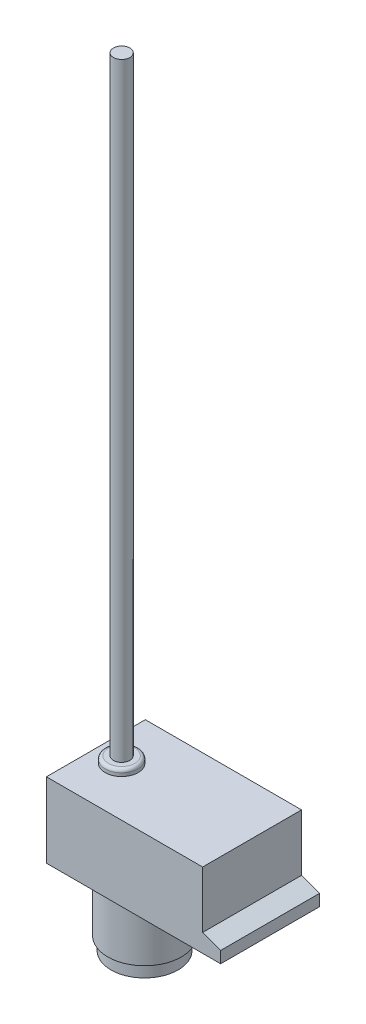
ISO-10303-21;
HEADER;
FILE_DESCRIPTION(('STEP AP214'),'2;1');
FILE_NAME('part.step','',(''),(''),'','','');
FILE_SCHEMA(('AUTOMOTIVE_DESIGN { 1 0 10303 214 1 1 1 1 }'));
ENDSEC;
DATA;
#1=APPLICATION_CONTEXT('core data for automotive mechanical design processes');
#2=APPLICATION_PROTOCOL_DEFINITION('international standard','automotive_design',2000,#1);
#3=PRODUCT_CONTEXT('',#1,'mechanical');
#4=PRODUCT('Part','Part','',(#3));
#5=PRODUCT_RELATED_PRODUCT_CATEGORY('part','',(#4));
#6=PRODUCT_DEFINITION_FORMATION('','',#4);
#7=PRODUCT_DEFINITION_CONTEXT('part definition',#1,'design');
#8=PRODUCT_DEFINITION('design','',#6,#7);
#9=PRODUCT_DEFINITION_SHAPE('','',#8);
#10=(LENGTH_UNIT() NAMED_UNIT(*) SI_UNIT(.MILLI.,.METRE.));
#11=(NAMED_UNIT(*) PLANE_ANGLE_UNIT() SI_UNIT($,.RADIAN.));
#12=(NAMED_UNIT(*) SI_UNIT($,.STERADIAN.) SOLID_ANGLE_UNIT());
#13=UNCERTAINTY_MEASURE_WITH_UNIT(LENGTH_MEASURE(1.E-05),#10,'distance_accuracy_value','');
#14=(GEOMETRIC_REPRESENTATION_CONTEXT(3) GLOBAL_UNCERTAINTY_ASSIGNED_CONTEXT((#13)) GLOBAL_UNIT_ASSIGNED_CONTEXT((#10,
#11,#12)) REPRESENTATION_CONTEXT('',''));
#15=CARTESIAN_POINT('',(0.,0.,0.));
#16=DIRECTION('',(0.,0.,1.));
#17=DIRECTION('',(1.,0.,0.));
#18=AXIS2_PLACEMENT_3D('',#15,#16,#17);
#19=CARTESIAN_POINT('',(-34.35,0.,19.5));
#20=DIRECTION('',(1.,0.,0.));
#21=DIRECTION('',(0.,0.,-1.));
#22=AXIS2_PLACEMENT_3D('',#19,#20,#21);
#23=PLANE('',#22);
#24=DIRECTION('',(0.,-1.,0.));
#25=VECTOR('',#24,1.);
#26=CARTESIAN_POINT('',(-34.35,0.,-19.5));
#27=LINE('',#26,#25);
#28=CARTESIAN_POINT('',(-34.35,29.4999999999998,-19.5));
#29=VERTEX_POINT('',#28);
#30=CARTESIAN_POINT('',(-34.35,0.,-19.5));
#31=VERTEX_POINT('',#30);
#32=EDGE_CURVE('E124',#29,#31,#27,.T.);
#33=ORIENTED_EDGE('',*,*,#32,.T.);
#34=DIRECTION('',(0.,0.,-1.));
#35=VECTOR('',#34,1.);
#36=CARTESIAN_POINT('',(-34.35,0.,19.5));
#37=LINE('',#36,#35);
#38=CARTESIAN_POINT('',(-34.35,0.,19.5));
#39=VERTEX_POINT('',#38);
#40=EDGE_CURVE('E142',#39,#31,#37,.T.);
#41=ORIENTED_EDGE('',*,*,#40,.F.);
#42=DIRECTION('',(0.,-1.,0.));
#43=VECTOR('',#42,1.);
#44=CARTESIAN_POINT('',(-34.35,0.,19.5));
#45=LINE('',#44,#43);
#46=CARTESIAN_POINT('',(-34.35,29.4999999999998,19.5));
#47=VERTEX_POINT('',#46);
#48=EDGE_CURVE('E135',#47,#39,#45,.T.);
#49=ORIENTED_EDGE('',*,*,#48,.F.);
#50=DIRECTION('',(0.,0.,-1.));
#51=VECTOR('',#50,1.);
#52=CARTESIAN_POINT('',(-34.35,29.4999999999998,19.5));
#53=LINE('',#52,#51);
#54=EDGE_CURVE('E120',#47,#29,#53,.T.);
#55=ORIENTED_EDGE('',*,*,#54,.T.);
#56=EDGE_LOOP('',(#33,#41,#49,#55));
#57=FACE_BOUND('',#56,.T.);
#58=ADVANCED_FACE('F35',(#57),#23,.F.);
#59=CARTESIAN_POINT('',(-34.35,0.,19.5));
#60=DIRECTION('',(0.,1.,0.));
#61=DIRECTION('',(-1.,0.,0.));
#62=AXIS2_PLACEMENT_3D('',#59,#60,#61);
#63=PLANE('',#62);
#64=CARTESIAN_POINT('',(4.84999999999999,0.,10.));
#65=DIRECTION('',(0.,-1.,0.));
#66=DIRECTION('',(0.,0.,-1.));
#67=AXIS2_PLACEMENT_3D('',#64,#65,#66);
#68=CIRCLE('',#67,1.64999999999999);
#69=CARTESIAN_POINT('',(4.84999999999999,0.,8.35000000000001));
#70=VERTEX_POINT('',#69);
#71=EDGE_CURVE('E237',#70,#70,#68,.T.);
#72=ORIENTED_EDGE('',*,*,#71,.F.);
#73=EDGE_LOOP('',(#72));
#74=FACE_BOUND('',#73,.T.);
#75=CARTESIAN_POINT('',(4.84999999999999,0.,-10.));
#76=DIRECTION('',(0.,-1.,0.));
#77=DIRECTION('',(0.,0.,-1.));
#78=AXIS2_PLACEMENT_3D('',#75,#76,#77);
#79=CIRCLE('',#78,1.64999999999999);
#80=CARTESIAN_POINT('',(4.84999999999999,0.,-11.65));
#81=VERTEX_POINT('',#80);
#82=EDGE_CURVE('E239',#81,#81,#79,.T.);
#83=ORIENTED_EDGE('',*,*,#82,.F.);
#84=EDGE_LOOP('',(#83));
#85=FACE_BOUND('',#84,.T.);
#86=CARTESIAN_POINT('',(-15.15,0.,0.));
#87=DIRECTION('',(0.,1.,0.));
#88=DIRECTION('',(0.,0.,1.));
#89=AXIS2_PLACEMENT_3D('',#86,#87,#88);
#90=CIRCLE('',#89,14.5);
#91=CARTESIAN_POINT('',(-15.15,0.,14.5));
#92=VERTEX_POINT('',#91);
#93=EDGE_CURVE('E128',#92,#92,#90,.T.);
#94=ORIENTED_EDGE('',*,*,#93,.T.);
#95=EDGE_LOOP('',(#94));
#96=FACE_BOUND('',#95,.T.);
#97=DIRECTION('',(1.,0.,0.));
#98=VECTOR('',#97,1.);
#99=CARTESIAN_POINT('',(-34.35,0.,-19.5));
#100=LINE('',#99,#98);
#101=CARTESIAN_POINT('',(34.35,0.,-19.5));
#102=VERTEX_POINT('',#101);
#103=EDGE_CURVE('E127',#31,#102,#100,.T.);
#104=ORIENTED_EDGE('',*,*,#103,.T.);
#105=DIRECTION('',(0.,0.,-1.));
#106=VECTOR('',#105,1.);
#107=CARTESIAN_POINT('',(34.35,0.,19.5));
#108=LINE('',#107,#106);
#109=CARTESIAN_POINT('',(34.35,0.,19.5));
#110=VERTEX_POINT('',#109);
#111=EDGE_CURVE('E139',#110,#102,#108,.T.);
#112=ORIENTED_EDGE('',*,*,#111,.F.);
#113=DIRECTION('',(1.,0.,0.));
#114=VECTOR('',#113,1.);
#115=CARTESIAN_POINT('',(-34.35,0.,19.5));
#116=LINE('',#115,#114);
#117=EDGE_CURVE('E91',#39,#110,#116,.T.);
#118=ORIENTED_EDGE('',*,*,#117,.F.);
#119=ORIENTED_EDGE('',*,*,#40,.T.);
#120=EDGE_LOOP('',(#104,#112,#118,#119));
#121=FACE_BOUND('',#120,.T.);
#122=ADVANCED_FACE('F166',(#74,#85,#96,#121),#63,.F.);
#123=CARTESIAN_POINT('',(34.35,0.,19.5));
#124=DIRECTION('',(-1.,0.,0.));
#125=DIRECTION('',(0.,0.,1.));
#126=AXIS2_PLACEMENT_3D('',#123,#124,#125);
#127=PLANE('',#126);
#128=DIRECTION('',(0.,1.,0.));
#129=VECTOR('',#128,1.);
#130=CARTESIAN_POINT('',(34.35,0.,-19.5));
#131=LINE('',#130,#129);
#132=CARTESIAN_POINT('',(34.35,4.572,-19.5));
#133=VERTEX_POINT('',#132);
#134=EDGE_CURVE('E130',#102,#133,#131,.T.);
#135=ORIENTED_EDGE('',*,*,#134,.T.);
#136=DIRECTION('',(0.,0.,-1.));
#137=VECTOR('',#136,1.);
#138=CARTESIAN_POINT('',(34.35,4.572,19.5));
#139=LINE('',#138,#137);
#140=CARTESIAN_POINT('',(34.35,4.572,19.5));
#141=VERTEX_POINT('',#140);
#142=EDGE_CURVE('E115',#141,#133,#139,.T.);
#143=ORIENTED_EDGE('',*,*,#142,.F.);
#144=DIRECTION('',(0.,1.,0.));
#145=VECTOR('',#144,1.);
#146=CARTESIAN_POINT('',(34.35,0.,19.5));
#147=LINE('',#146,#145);
#148=EDGE_CURVE('E106',#110,#141,#147,.T.);
#149=ORIENTED_EDGE('',*,*,#148,.F.);
#150=ORIENTED_EDGE('',*,*,#111,.T.);
#151=EDGE_LOOP('',(#135,#143,#149,#150));
#152=FACE_BOUND('',#151,.T.);
#153=ADVANCED_FACE('F171',(#152),#127,.F.);
#154=CARTESIAN_POINT('',(34.35,4.572,19.5));
#155=DIRECTION('',(-0.340553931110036,-0.94022498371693,0.));
#156=DIRECTION('',(0.94022498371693,-0.340553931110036,0.));
#157=AXIS2_PLACEMENT_3D('',#154,#155,#156);
#158=PLANE('',#157);
#159=DIRECTION('',(-0.94022498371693,0.340553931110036,0.));
#160=VECTOR('',#159,1.);
#161=CARTESIAN_POINT('',(34.35,4.572,-19.5));
#162=LINE('',#161,#160);
#163=CARTESIAN_POINT('',(27.238,7.14799999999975,-19.5));
#164=VERTEX_POINT('',#163);
#165=EDGE_CURVE('E114',#133,#164,#162,.T.);
#166=ORIENTED_EDGE('',*,*,#165,.T.);
#167=DIRECTION('',(0.,0.,-1.));
#168=VECTOR('',#167,1.);
#169=CARTESIAN_POINT('',(27.238,7.14799999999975,19.5));
#170=LINE('',#169,#168);
#171=CARTESIAN_POINT('',(27.238,7.14799999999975,19.5));
#172=VERTEX_POINT('',#171);
#173=EDGE_CURVE('E111',#172,#164,#170,.T.);
#174=ORIENTED_EDGE('',*,*,#173,.F.);
#175=DIRECTION('',(-0.94022498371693,0.340553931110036,0.));
#176=VECTOR('',#175,1.);
#177=CARTESIAN_POINT('',(34.35,4.572,19.5));
#178=LINE('',#177,#176);
#179=EDGE_CURVE('E100',#141,#172,#178,.T.);
#180=ORIENTED_EDGE('',*,*,#179,.F.);
#181=ORIENTED_EDGE('',*,*,#142,.T.);
#182=EDGE_LOOP('',(#166,#174,#180,#181));
#183=FACE_BOUND('',#182,.T.);
#184=ADVANCED_FACE('F112',(#183),#158,.F.);
#185=CARTESIAN_POINT('',(27.238,7.14799999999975,19.5));
#186=DIRECTION('',(-1.,0.,0.));
#187=DIRECTION('',(0.,0.,1.));
#188=AXIS2_PLACEMENT_3D('',#185,#186,#187);
#189=PLANE('',#188);
#190=DIRECTION('',(0.,1.,0.));
#191=VECTOR('',#190,1.);
#192=CARTESIAN_POINT('',(27.238,7.14799999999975,-19.5));
#193=LINE('',#192,#191);
#194=CARTESIAN_POINT('',(27.238,29.4999999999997,-19.5));
#195=VERTEX_POINT('',#194);
#196=EDGE_CURVE('E76',#164,#195,#193,.T.);
#197=ORIENTED_EDGE('',*,*,#196,.T.);
#198=DIRECTION('',(0.,0.,-1.));
#199=VECTOR('',#198,1.);
#200=CARTESIAN_POINT('',(27.238,29.4999999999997,19.5));
#201=LINE('',#200,#199);
#202=CARTESIAN_POINT('',(27.238,29.4999999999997,19.5));
#203=VERTEX_POINT('',#202);
#204=EDGE_CURVE('E116',#203,#195,#201,.T.);
#205=ORIENTED_EDGE('',*,*,#204,.F.);
#206=DIRECTION('',(0.,1.,0.));
#207=VECTOR('',#206,1.);
#208=CARTESIAN_POINT('',(27.238,7.14799999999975,19.5));
#209=LINE('',#208,#207);
#210=EDGE_CURVE('E104',#172,#203,#209,.T.);
#211=ORIENTED_EDGE('',*,*,#210,.F.);
#212=ORIENTED_EDGE('',*,*,#173,.T.);
#213=EDGE_LOOP('',(#197,#205,#211,#212));
#214=FACE_BOUND('',#213,.T.);
#215=ADVANCED_FACE('F118',(#214),#189,.F.);
#216=CARTESIAN_POINT('',(27.238,29.4999999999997,19.5));
#217=DIRECTION('',(0.,-1.,0.));
#218=DIRECTION('',(1.,0.,0.));
#219=AXIS2_PLACEMENT_3D('',#216,#217,#218);
#220=PLANE('',#219);
#221=CARTESIAN_POINT('',(-24.19,29.4999999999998,0.));
#222=DIRECTION('',(0.,-1.,0.));
#223=DIRECTION('',(1.,0.,0.));
#224=AXIS2_PLACEMENT_3D('',#221,#222,#223);
#225=CIRCLE('',#224,6.50000000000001);
#226=CARTESIAN_POINT('',(-17.69,29.4999999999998,0.));
#227=VERTEX_POINT('',#226);
#228=EDGE_CURVE('E144',#227,#227,#225,.F.);
#229=ORIENTED_EDGE('',*,*,#228,.F.);
#230=EDGE_LOOP('',(#229));
#231=FACE_BOUND('',#230,.T.);
#232=DIRECTION('',(-1.,0.,0.));
#233=VECTOR('',#232,1.);
#234=CARTESIAN_POINT('',(27.238,29.4999999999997,-19.5));
#235=LINE('',#234,#233);
#236=EDGE_CURVE('E82',#195,#29,#235,.T.);
#237=ORIENTED_EDGE('',*,*,#236,.T.);
#238=ORIENTED_EDGE('',*,*,#54,.F.);
#239=DIRECTION('',(-1.,0.,0.));
#240=VECTOR('',#239,1.);
#241=CARTESIAN_POINT('',(27.238,29.4999999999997,19.5));
#242=LINE('',#241,#240);
#243=EDGE_CURVE('E52',#203,#47,#242,.T.);
#244=ORIENTED_EDGE('',*,*,#243,.F.);
#245=ORIENTED_EDGE('',*,*,#204,.T.);
#246=EDGE_LOOP('',(#237,#238,#244,#245));
#247=FACE_BOUND('',#246,.T.);
#248=ADVANCED_FACE('F182',(#231,#247),#220,.F.);
#249=CARTESIAN_POINT('',(0.,0.,19.5));
#250=DIRECTION('',(0.,0.,1.));
#251=DIRECTION('',(1.,0.,0.));
#252=AXIS2_PLACEMENT_3D('',#249,#250,#251);
#253=PLANE('',#252);
#254=ORIENTED_EDGE('',*,*,#48,.T.);
#255=ORIENTED_EDGE('',*,*,#117,.T.);
#256=ORIENTED_EDGE('',*,*,#148,.T.);
#257=ORIENTED_EDGE('',*,*,#179,.T.);
#258=ORIENTED_EDGE('',*,*,#210,.T.);
#259=ORIENTED_EDGE('',*,*,#243,.T.);
#260=EDGE_LOOP('',(#254,#255,#256,#257,#258,#259));
#261=FACE_BOUND('',#260,.T.);
#262=ADVANCED_FACE('F102',(#261),#253,.T.);
#263=CARTESIAN_POINT('',(0.,0.,-19.5));
#264=DIRECTION('',(0.,0.,1.));
#265=DIRECTION('',(1.,0.,0.));
#266=AXIS2_PLACEMENT_3D('',#263,#264,#265);
#267=PLANE('',#266);
#268=ORIENTED_EDGE('',*,*,#32,.F.);
#269=ORIENTED_EDGE('',*,*,#236,.F.);
#270=ORIENTED_EDGE('',*,*,#196,.F.);
#271=ORIENTED_EDGE('',*,*,#165,.F.);
#272=ORIENTED_EDGE('',*,*,#134,.F.);
#273=ORIENTED_EDGE('',*,*,#103,.F.);
#274=EDGE_LOOP('',(#268,#269,#270,#271,#272,#273));
#275=FACE_BOUND('',#274,.T.);
#276=ADVANCED_FACE('F186',(#275),#267,.F.);
#277=CARTESIAN_POINT('',(-15.15,29.4999999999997,0.));
#278=DIRECTION('',(0.,1.,0.));
#279=DIRECTION('',(0.,0.,1.));
#280=AXIS2_PLACEMENT_3D('',#277,#278,#279);
#281=CYLINDRICAL_SURFACE('',#280,14.5);
#282=CARTESIAN_POINT('',(-15.15,-24.9200000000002,0.));
#283=DIRECTION('',(0.,1.,0.));
#284=DIRECTION('',(0.,0.,1.));
#285=AXIS2_PLACEMENT_3D('',#282,#283,#284);
#286=CIRCLE('',#285,14.5);
#287=CARTESIAN_POINT('',(-15.15,-24.9200000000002,14.5));
#288=VERTEX_POINT('',#287);
#289=EDGE_CURVE('E259',#288,#288,#286,.T.);
#290=ORIENTED_EDGE('',*,*,#289,.T.);
#291=EDGE_LOOP('',(#290));
#292=FACE_BOUND('',#291,.T.);
#293=ORIENTED_EDGE('',*,*,#93,.F.);
#294=EDGE_LOOP('',(#293));
#295=FACE_BOUND('',#294,.T.);
#296=ADVANCED_FACE('F189',(#292,#295),#281,.T.);
#297=CARTESIAN_POINT('',(-15.15,-24.9200000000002,14.5));
#298=DIRECTION('',(0.,-1.,0.));
#299=DIRECTION('',(0.,0.,-1.));
#300=AXIS2_PLACEMENT_3D('',#297,#298,#299);
#301=PLANE('',#300);
#302=CARTESIAN_POINT('',(-15.15,-24.9200000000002,0.));
#303=DIRECTION('',(0.,1.,0.));
#304=DIRECTION('',(0.,0.,1.));
#305=AXIS2_PLACEMENT_3D('',#302,#303,#304);
#306=CIRCLE('',#305,13.23);
#307=CARTESIAN_POINT('',(-15.15,-24.9200000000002,13.23));
#308=VERTEX_POINT('',#307);
#309=EDGE_CURVE('E256',#308,#308,#306,.T.);
#310=ORIENTED_EDGE('',*,*,#309,.T.);
#311=EDGE_LOOP('',(#310));
#312=FACE_BOUND('',#311,.T.);
#313=ORIENTED_EDGE('',*,*,#289,.F.);
#314=EDGE_LOOP('',(#313));
#315=FACE_BOUND('',#314,.T.);
#316=ADVANCED_FACE('F195',(#312,#315),#301,.T.);
#317=CARTESIAN_POINT('',(-15.15,29.4999999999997,0.));
#318=DIRECTION('',(0.,1.,0.));
#319=DIRECTION('',(0.,0.,1.));
#320=AXIS2_PLACEMENT_3D('',#317,#318,#319);
#321=CYLINDRICAL_SURFACE('',#320,13.23);
#322=CARTESIAN_POINT('',(-15.15,-30.0000000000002,0.));
#323=DIRECTION('',(0.,1.,0.));
#324=DIRECTION('',(0.,0.,1.));
#325=AXIS2_PLACEMENT_3D('',#322,#323,#324);
#326=CIRCLE('',#325,13.23);
#327=CARTESIAN_POINT('',(-15.15,-30.0000000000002,13.23));
#328=VERTEX_POINT('',#327);
#329=EDGE_CURVE('E251',#328,#328,#326,.T.);
#330=ORIENTED_EDGE('',*,*,#329,.T.);
#331=EDGE_LOOP('',(#330));
#332=FACE_BOUND('',#331,.T.);
#333=ORIENTED_EDGE('',*,*,#309,.F.);
#334=EDGE_LOOP('',(#333));
#335=FACE_BOUND('',#334,.T.);
#336=ADVANCED_FACE('F199',(#332,#335),#321,.T.);
#337=CARTESIAN_POINT('',(-15.15,-30.0000000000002,13.23));
#338=DIRECTION('',(0.,-1.,0.));
#339=DIRECTION('',(0.,0.,-1.));
#340=AXIS2_PLACEMENT_3D('',#337,#338,#339);
#341=PLANE('',#340);
#342=ORIENTED_EDGE('',*,*,#329,.F.);
#343=EDGE_LOOP('',(#342));
#344=FACE_BOUND('',#343,.T.);
#345=ADVANCED_FACE('F203',(#344),#341,.T.);
#346=CARTESIAN_POINT('',(-24.19,32.0399999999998,0.));
#347=DIRECTION('',(0.,-1.,0.));
#348=DIRECTION('',(1.,0.,0.));
#349=AXIS2_PLACEMENT_3D('',#346,#347,#348);
#350=CYLINDRICAL_SURFACE('',#349,6.50000000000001);
#351=CARTESIAN_POINT('',(-24.19,30.7699999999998,0.));
#352=DIRECTION('',(0.,1.,0.));
#353=DIRECTION('',(-1.,0.,0.));
#354=AXIS2_PLACEMENT_3D('',#351,#352,#353);
#355=CIRCLE('',#354,6.50000000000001);
#356=CARTESIAN_POINT('',(-30.69,30.7699999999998,0.));
#357=VERTEX_POINT('',#356);
#358=EDGE_CURVE('E11',#357,#357,#355,.F.);
#359=ORIENTED_EDGE('',*,*,#358,.T.);
#360=EDGE_LOOP('',(#359));
#361=FACE_BOUND('',#360,.T.);
#362=ORIENTED_EDGE('',*,*,#228,.T.);
#363=EDGE_LOOP('',(#362));
#364=FACE_BOUND('',#363,.T.);
#365=ADVANCED_FACE('F161',(#361,#364),#350,.T.);
#366=CARTESIAN_POINT('',(-24.19,32.0399999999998,0.));
#367=DIRECTION('',(0.,1.,0.));
#368=DIRECTION('',(-1.,0.,0.));
#369=AXIS2_PLACEMENT_3D('',#366,#367,#368);
#370=PLANE('',#369);
#371=CARTESIAN_POINT('',(-24.19,32.0399999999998,0.));
#372=DIRECTION('',(0.,1.,0.));
#373=DIRECTION('',(-1.,0.,0.));
#374=AXIS2_PLACEMENT_3D('',#371,#372,#373);
#375=CIRCLE('',#374,3.25);
#376=CARTESIAN_POINT('',(-27.44,32.0399999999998,0.));
#377=VERTEX_POINT('',#376);
#378=EDGE_CURVE('E247',#377,#377,#375,.T.);
#379=ORIENTED_EDGE('',*,*,#378,.F.);
#380=EDGE_LOOP('',(#379));
#381=FACE_BOUND('',#380,.T.);
#382=CARTESIAN_POINT('',(-24.19,32.0399999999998,0.));
#383=DIRECTION('',(0.,1.,0.));
#384=DIRECTION('',(-1.,0.,0.));
#385=AXIS2_PLACEMENT_3D('',#382,#383,#384);
#386=CIRCLE('',#385,5.23);
#387=CARTESIAN_POINT('',(-29.42,32.0399999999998,0.));
#388=VERTEX_POINT('',#387);
#389=EDGE_CURVE('E44',#388,#388,#386,.T.);
#390=ORIENTED_EDGE('',*,*,#389,.T.);
#391=EDGE_LOOP('',(#390));
#392=FACE_BOUND('',#391,.T.);
#393=ADVANCED_FACE('F149',(#381,#392),#370,.T.);
#394=CARTESIAN_POINT('',(-24.19,30.7699999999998,0.));
#395=DIRECTION('',(0.,1.,0.));
#396=DIRECTION('',(-1.,0.,0.));
#397=AXIS2_PLACEMENT_3D('',#394,#395,#396);
#398=TOROIDAL_SURFACE('',#397,5.23,1.27);
#399=ORIENTED_EDGE('',*,*,#358,.F.);
#400=EDGE_LOOP('',(#399));
#401=FACE_BOUND('',#400,.T.);
#402=ORIENTED_EDGE('',*,*,#389,.F.);
#403=EDGE_LOOP('',(#402));
#404=FACE_BOUND('',#403,.T.);
#405=ADVANCED_FACE('F37',(#401,#404),#398,.T.);
#406=CARTESIAN_POINT('',(-24.1899999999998,272.04,0.));
#407=DIRECTION('',(0.,-1.,0.));
#408=DIRECTION('',(1.,0.,0.));
#409=AXIS2_PLACEMENT_3D('',#406,#407,#408);
#410=CYLINDRICAL_SURFACE('',#409,3.25);
#411=CARTESIAN_POINT('',(-24.1899999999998,272.04,0.));
#412=DIRECTION('',(0.,1.,0.));
#413=DIRECTION('',(-1.,0.,0.));
#414=AXIS2_PLACEMENT_3D('',#411,#412,#413);
#415=CIRCLE('',#414,3.25);
#416=CARTESIAN_POINT('',(-27.4399999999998,272.04,0.));
#417=VERTEX_POINT('',#416);
#418=EDGE_CURVE('E248',#417,#417,#415,.T.);
#419=ORIENTED_EDGE('',*,*,#418,.F.);
#420=EDGE_LOOP('',(#419));
#421=FACE_BOUND('',#420,.T.);
#422=ORIENTED_EDGE('',*,*,#378,.T.);
#423=EDGE_LOOP('',(#422));
#424=FACE_BOUND('',#423,.T.);
#425=ADVANCED_FACE('F152',(#421,#424),#410,.T.);
#426=CARTESIAN_POINT('',(-24.1899999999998,272.04,0.));
#427=DIRECTION('',(0.,1.,0.));
#428=DIRECTION('',(-1.,0.,0.));
#429=AXIS2_PLACEMENT_3D('',#426,#427,#428);
#430=PLANE('',#429);
#431=ORIENTED_EDGE('',*,*,#418,.T.);
#432=EDGE_LOOP('',(#431));
#433=FACE_BOUND('',#432,.T.);
#434=ADVANCED_FACE('F158',(#433),#430,.T.);
#435=CARTESIAN_POINT('',(4.84999999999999,5.999988,-10.));
#436=DIRECTION('',(0.,-1.,0.));
#437=DIRECTION('',(0.,0.,-1.));
#438=AXIS2_PLACEMENT_3D('',#435,#436,#437);
#439=CONICAL_SURFACE('',#438,1.65,1.02974425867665);
#440=CARTESIAN_POINT('',(4.84999999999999,6.99140802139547,-10.));
#441=VERTEX_POINT('',#440);
#442=VERTEX_LOOP('',#441);
#443=FACE_BOUND('',#442,.T.);
#444=CARTESIAN_POINT('',(4.84999999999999,5.999988,-10.));
#445=DIRECTION('',(0.,-1.,0.));
#446=DIRECTION('',(0.,0.,-1.));
#447=AXIS2_PLACEMENT_3D('',#444,#445,#446);
#448=CIRCLE('',#447,1.65);
#449=CARTESIAN_POINT('',(4.84999999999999,5.999988,-11.65));
#450=VERTEX_POINT('',#449);
#451=EDGE_CURVE('E244',#450,#450,#448,.T.);
#452=ORIENTED_EDGE('',*,*,#451,.T.);
#453=EDGE_LOOP('',(#452));
#454=FACE_BOUND('',#453,.T.);
#455=ADVANCED_FACE('F213',(#443,#454),#439,.F.);
#456=CARTESIAN_POINT('',(4.84999999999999,0.,-10.));
#457=DIRECTION('',(0.,-1.,0.));
#458=DIRECTION('',(0.,0.,-1.));
#459=AXIS2_PLACEMENT_3D('',#456,#457,#458);
#460=CYLINDRICAL_SURFACE('',#459,1.64999999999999);
#461=ORIENTED_EDGE('',*,*,#451,.F.);
#462=EDGE_LOOP('',(#461));
#463=FACE_BOUND('',#462,.T.);
#464=ORIENTED_EDGE('',*,*,#82,.T.);
#465=EDGE_LOOP('',(#464));
#466=FACE_BOUND('',#465,.T.);
#467=ADVANCED_FACE('F217',(#463,#466),#460,.F.);
#468=CARTESIAN_POINT('',(4.84999999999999,5.999988,10.));
#469=DIRECTION('',(0.,-1.,0.));
#470=DIRECTION('',(0.,0.,-1.));
#471=AXIS2_PLACEMENT_3D('',#468,#469,#470);
#472=CONICAL_SURFACE('',#471,1.65,1.02974425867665);
#473=CARTESIAN_POINT('',(4.84999999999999,6.99140802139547,10.));
#474=VERTEX_POINT('',#473);
#475=VERTEX_LOOP('',#474);
#476=FACE_BOUND('',#475,.T.);
#477=CARTESIAN_POINT('',(4.84999999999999,5.999988,10.));
#478=DIRECTION('',(0.,-1.,0.));
#479=DIRECTION('',(0.,0.,-1.));
#480=AXIS2_PLACEMENT_3D('',#477,#478,#479);
#481=CIRCLE('',#480,1.65);
#482=CARTESIAN_POINT('',(4.84999999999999,5.999988,8.35));
#483=VERTEX_POINT('',#482);
#484=EDGE_CURVE('E234',#483,#483,#481,.T.);
#485=ORIENTED_EDGE('',*,*,#484,.T.);
#486=EDGE_LOOP('',(#485));
#487=FACE_BOUND('',#486,.T.);
#488=ADVANCED_FACE('F221',(#476,#487),#472,.F.);
#489=CARTESIAN_POINT('',(4.84999999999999,0.,10.));
#490=DIRECTION('',(0.,-1.,0.));
#491=DIRECTION('',(0.,0.,-1.));
#492=AXIS2_PLACEMENT_3D('',#489,#490,#491);
#493=CYLINDRICAL_SURFACE('',#492,1.64999999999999);
#494=ORIENTED_EDGE('',*,*,#484,.F.);
#495=EDGE_LOOP('',(#494));
#496=FACE_BOUND('',#495,.T.);
#497=ORIENTED_EDGE('',*,*,#71,.T.);
#498=EDGE_LOOP('',(#497));
#499=FACE_BOUND('',#498,.T.);
#500=ADVANCED_FACE('F225',(#496,#499),#493,.F.);
#501=CLOSED_SHELL('',(#58,#122,#153,#184,#215,#248,#262,#276,#296,#316,#336,#345,#365,#393,#405,
#425,#434,#455,#467,#488,#500));
#502=MANIFOLD_SOLID_BREP('B2',#501);
#503=ADVANCED_BREP_SHAPE_REPRESENTATION('',(#18,#502),#14);
#504=SHAPE_DEFINITION_REPRESENTATION(#9,#503);
ENDSEC;
END-ISO-10303-21;
